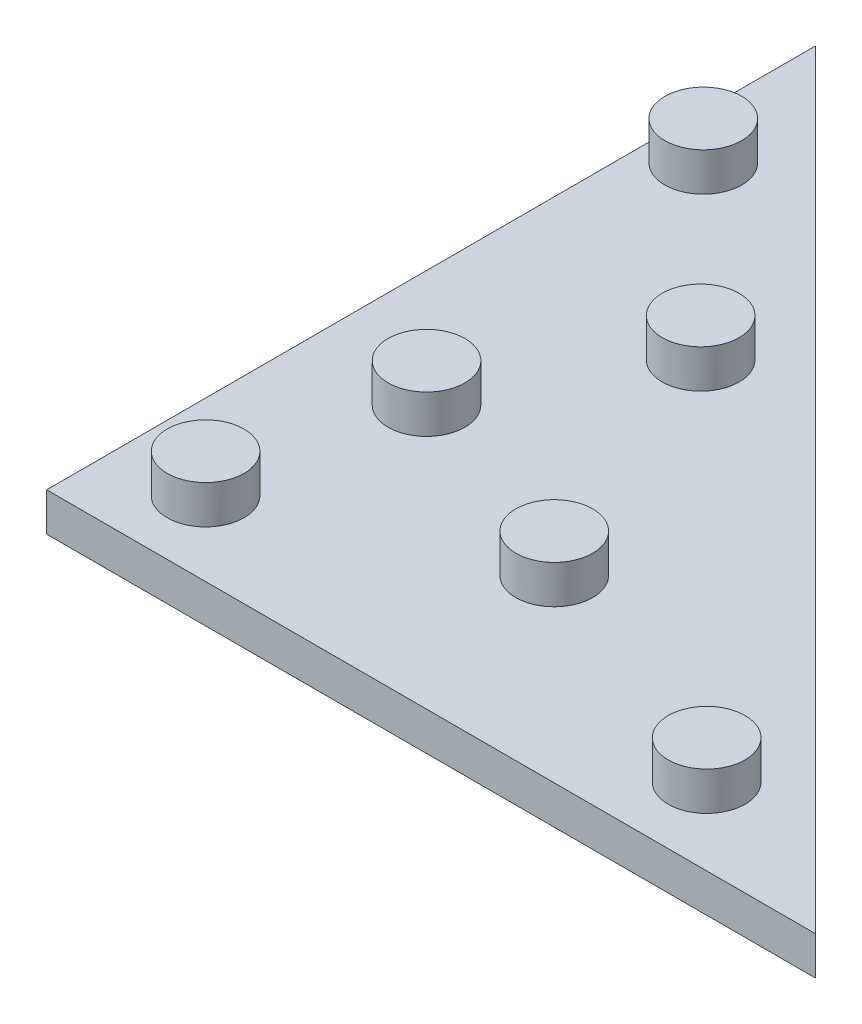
ISO-10303-21;
HEADER;
FILE_DESCRIPTION(('STEP AP214'),'2;1');
FILE_NAME('part.step','',(''),(''),'','','');
FILE_SCHEMA(('AUTOMOTIVE_DESIGN { 1 0 10303 214 1 1 1 1 }'));
ENDSEC;
DATA;
#1=APPLICATION_CONTEXT('core data for automotive mechanical design processes');
#2=APPLICATION_PROTOCOL_DEFINITION('international standard','automotive_design',2000,#1);
#3=PRODUCT_CONTEXT('',#1,'mechanical');
#4=PRODUCT('Part','Part','',(#3));
#5=PRODUCT_RELATED_PRODUCT_CATEGORY('part','',(#4));
#6=PRODUCT_DEFINITION_FORMATION('','',#4);
#7=PRODUCT_DEFINITION_CONTEXT('part definition',#1,'design');
#8=PRODUCT_DEFINITION('design','',#6,#7);
#9=PRODUCT_DEFINITION_SHAPE('','',#8);
#10=(LENGTH_UNIT() NAMED_UNIT(*) SI_UNIT(.MILLI.,.METRE.));
#11=(NAMED_UNIT(*) PLANE_ANGLE_UNIT() SI_UNIT($,.RADIAN.));
#12=(NAMED_UNIT(*) SI_UNIT($,.STERADIAN.) SOLID_ANGLE_UNIT());
#13=UNCERTAINTY_MEASURE_WITH_UNIT(LENGTH_MEASURE(1.E-05),#10,'distance_accuracy_value','');
#14=(GEOMETRIC_REPRESENTATION_CONTEXT(3) GLOBAL_UNCERTAINTY_ASSIGNED_CONTEXT((#13)) GLOBAL_UNIT_ASSIGNED_CONTEXT((#10,
#11,#12)) REPRESENTATION_CONTEXT('',''));
#15=CARTESIAN_POINT('',(0.,0.,0.));
#16=DIRECTION('',(0.,0.,1.));
#17=DIRECTION('',(1.,0.,0.));
#18=AXIS2_PLACEMENT_3D('',#15,#16,#17);
#19=CARTESIAN_POINT('',(0.,5.,0.));
#20=DIRECTION('',(0.,-1.,0.));
#21=DIRECTION('',(0.,0.,-1.));
#22=AXIS2_PLACEMENT_3D('',#19,#20,#21);
#23=PLANE('',#22);
#24=CARTESIAN_POINT('',(27.8957237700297,5.,-57.1843432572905));
#25=DIRECTION('',(0.,-1.,0.));
#26=DIRECTION('',(0.,0.,-1.));
#27=AXIS2_PLACEMENT_3D('',#24,#25,#26);
#28=CIRCLE('',#27,5.);
#29=CARTESIAN_POINT('',(27.8957237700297,5.,-62.1843432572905));
#30=VERTEX_POINT('',#29);
#31=EDGE_CURVE('E41',#30,#30,#28,.F.);
#32=ORIENTED_EDGE('',*,*,#31,.F.);
#33=EDGE_LOOP('',(#32));
#34=FACE_BOUND('',#33,.T.);
#35=CARTESIAN_POINT('',(15.1620921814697,5.,-34.2543620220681));
#36=DIRECTION('',(0.,-1.,0.));
#37=DIRECTION('',(0.,0.,-1.));
#38=AXIS2_PLACEMENT_3D('',#35,#36,#37);
#39=CIRCLE('',#38,5.);
#40=CARTESIAN_POINT('',(15.1620921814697,5.,-39.2543620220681));
#41=VERTEX_POINT('',#40);
#42=EDGE_CURVE('E105',#41,#41,#39,.F.);
#43=ORIENTED_EDGE('',*,*,#42,.F.);
#44=EDGE_LOOP('',(#43));
#45=FACE_BOUND('',#44,.T.);
#46=CARTESIAN_POINT('',(75.8578643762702,5.,-10.));
#47=DIRECTION('',(0.,-1.,0.));
#48=DIRECTION('',(0.,0.,-1.));
#49=AXIS2_PLACEMENT_3D('',#46,#47,#48);
#50=CIRCLE('',#49,5.);
#51=CARTESIAN_POINT('',(75.8578643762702,5.,-15.));
#52=VERTEX_POINT('',#51);
#53=EDGE_CURVE('E81',#52,#52,#50,.F.);
#54=ORIENTED_EDGE('',*,*,#53,.F.);
#55=EDGE_LOOP('',(#54));
#56=FACE_BOUND('',#55,.T.);
#57=DIRECTION('',(1.,0.,0.));
#58=VECTOR('',#57,1.);
#59=CARTESIAN_POINT('',(100.000000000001,5.,0.));
#60=LINE('',#59,#58);
#61=CARTESIAN_POINT('',(0.,5.,0.));
#62=VERTEX_POINT('',#61);
#63=CARTESIAN_POINT('',(100.000000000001,5.,0.));
#64=VERTEX_POINT('',#63);
#65=EDGE_CURVE('E94',#62,#64,#60,.T.);
#66=ORIENTED_EDGE('',*,*,#65,.T.);
#67=DIRECTION('',(-0.707106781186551,0.,-0.707106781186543));
#68=VECTOR('',#67,1.);
#69=CARTESIAN_POINT('',(0.,5.,-100.));
#70=LINE('',#69,#68);
#71=CARTESIAN_POINT('',(0.,5.,-100.));
#72=VERTEX_POINT('',#71);
#73=EDGE_CURVE('E52',#64,#72,#70,.T.);
#74=ORIENTED_EDGE('',*,*,#73,.T.);
#75=DIRECTION('',(0.,0.,1.));
#76=VECTOR('',#75,1.);
#77=CARTESIAN_POINT('',(0.,5.,0.));
#78=LINE('',#77,#76);
#79=EDGE_CURVE('E48',#72,#62,#78,.T.);
#80=ORIENTED_EDGE('',*,*,#79,.T.);
#81=EDGE_LOOP('',(#66,#74,#80));
#82=FACE_BOUND('',#81,.T.);
#83=CARTESIAN_POINT('',(10.989122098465,5.,-9.68869264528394));
#84=DIRECTION('',(0.,-1.,0.));
#85=DIRECTION('',(0.,0.,-1.));
#86=AXIS2_PLACEMENT_3D('',#83,#84,#85);
#87=CIRCLE('',#86,5.);
#88=CARTESIAN_POINT('',(10.989122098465,5.,-14.6886926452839));
#89=VERTEX_POINT('',#88);
#90=EDGE_CURVE('E102',#89,#89,#87,.F.);
#91=ORIENTED_EDGE('',*,*,#90,.F.);
#92=EDGE_LOOP('',(#91));
#93=FACE_BOUND('',#92,.T.);
#94=CARTESIAN_POINT('',(42.6651889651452,5.,-23.3712013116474));
#95=DIRECTION('',(0.,-1.,0.));
#96=DIRECTION('',(0.,0.,-1.));
#97=AXIS2_PLACEMENT_3D('',#94,#95,#96);
#98=CIRCLE('',#97,5.);
#99=CARTESIAN_POINT('',(42.6651889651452,5.,-28.3712013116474));
#100=VERTEX_POINT('',#99);
#101=EDGE_CURVE('E108',#100,#100,#98,.F.);
#102=ORIENTED_EDGE('',*,*,#101,.F.);
#103=EDGE_LOOP('',(#102));
#104=FACE_BOUND('',#103,.T.);
#105=CARTESIAN_POINT('',(5.8767929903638,5.,-79.5495227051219));
#106=DIRECTION('',(0.,-1.,0.));
#107=DIRECTION('',(0.,0.,-1.));
#108=AXIS2_PLACEMENT_3D('',#105,#106,#107);
#109=CIRCLE('',#108,5.);
#110=CARTESIAN_POINT('',(5.8767929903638,5.,-84.5495227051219));
#111=VERTEX_POINT('',#110);
#112=EDGE_CURVE('E11',#111,#111,#109,.F.);
#113=ORIENTED_EDGE('',*,*,#112,.F.);
#114=EDGE_LOOP('',(#113));
#115=FACE_BOUND('',#114,.T.);
#116=ADVANCED_FACE('F33',(#34,#45,#56,#82,#93,#104,#115),#23,.F.);
#117=CARTESIAN_POINT('',(100.000000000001,5.,0.));
#118=DIRECTION('',(0.,0.,-1.));
#119=DIRECTION('',(-1.,0.,0.));
#120=AXIS2_PLACEMENT_3D('',#117,#118,#119);
#121=PLANE('',#120);
#122=DIRECTION('',(1.,0.,0.));
#123=VECTOR('',#122,1.);
#124=CARTESIAN_POINT('',(100.000000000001,0.,0.));
#125=LINE('',#124,#123);
#126=CARTESIAN_POINT('',(0.,0.,0.));
#127=VERTEX_POINT('',#126);
#128=CARTESIAN_POINT('',(100.000000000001,0.,0.));
#129=VERTEX_POINT('',#128);
#130=EDGE_CURVE('E71',#127,#129,#125,.T.);
#131=ORIENTED_EDGE('',*,*,#130,.T.);
#132=DIRECTION('',(0.,-1.,0.));
#133=VECTOR('',#132,1.);
#134=CARTESIAN_POINT('',(100.000000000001,5.,0.));
#135=LINE('',#134,#133);
#136=EDGE_CURVE('E77',#64,#129,#135,.T.);
#137=ORIENTED_EDGE('',*,*,#136,.F.);
#138=ORIENTED_EDGE('',*,*,#65,.F.);
#139=DIRECTION('',(0.,-1.,0.));
#140=VECTOR('',#139,1.);
#141=CARTESIAN_POINT('',(0.,5.,0.));
#142=LINE('',#141,#140);
#143=EDGE_CURVE('E85',#62,#127,#142,.T.);
#144=ORIENTED_EDGE('',*,*,#143,.T.);
#145=EDGE_LOOP('',(#131,#137,#138,#144));
#146=FACE_BOUND('',#145,.T.);
#147=ADVANCED_FACE('F35',(#146),#121,.F.);
#148=CARTESIAN_POINT('',(0.,5.,-100.));
#149=DIRECTION('',(-0.707106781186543,0.,0.707106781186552));
#150=DIRECTION('',(0.707106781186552,0.,0.707106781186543));
#151=AXIS2_PLACEMENT_3D('',#148,#149,#150);
#152=PLANE('',#151);
#153=DIRECTION('',(-0.707106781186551,0.,-0.707106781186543));
#154=VECTOR('',#153,1.);
#155=CARTESIAN_POINT('',(0.,0.,-100.));
#156=LINE('',#155,#154);
#157=CARTESIAN_POINT('',(0.,0.,-100.));
#158=VERTEX_POINT('',#157);
#159=EDGE_CURVE('E67',#129,#158,#156,.T.);
#160=ORIENTED_EDGE('',*,*,#159,.T.);
#161=DIRECTION('',(0.,-1.,0.));
#162=VECTOR('',#161,1.);
#163=CARTESIAN_POINT('',(0.,5.,-100.));
#164=LINE('',#163,#162);
#165=EDGE_CURVE('E82',#72,#158,#164,.T.);
#166=ORIENTED_EDGE('',*,*,#165,.F.);
#167=ORIENTED_EDGE('',*,*,#73,.F.);
#168=ORIENTED_EDGE('',*,*,#136,.T.);
#169=EDGE_LOOP('',(#160,#166,#167,#168));
#170=FACE_BOUND('',#169,.T.);
#171=ADVANCED_FACE('F78',(#170),#152,.F.);
#172=CARTESIAN_POINT('',(0.,5.,0.));
#173=DIRECTION('',(1.,0.,0.));
#174=DIRECTION('',(0.,0.,-1.));
#175=AXIS2_PLACEMENT_3D('',#172,#173,#174);
#176=PLANE('',#175);
#177=DIRECTION('',(0.,0.,1.));
#178=VECTOR('',#177,1.);
#179=CARTESIAN_POINT('',(0.,0.,0.));
#180=LINE('',#179,#178);
#181=EDGE_CURVE('E72',#158,#127,#180,.T.);
#182=ORIENTED_EDGE('',*,*,#181,.T.);
#183=ORIENTED_EDGE('',*,*,#143,.F.);
#184=ORIENTED_EDGE('',*,*,#79,.F.);
#185=ORIENTED_EDGE('',*,*,#165,.T.);
#186=EDGE_LOOP('',(#182,#183,#184,#185));
#187=FACE_BOUND('',#186,.T.);
#188=ADVANCED_FACE('F180',(#187),#176,.F.);
#189=CARTESIAN_POINT('',(0.,0.,0.));
#190=DIRECTION('',(0.,-1.,0.));
#191=DIRECTION('',(0.,0.,-1.));
#192=AXIS2_PLACEMENT_3D('',#189,#190,#191);
#193=PLANE('',#192);
#194=ORIENTED_EDGE('',*,*,#130,.F.);
#195=ORIENTED_EDGE('',*,*,#181,.F.);
#196=ORIENTED_EDGE('',*,*,#159,.F.);
#197=EDGE_LOOP('',(#194,#195,#196));
#198=FACE_BOUND('',#197,.T.);
#199=ADVANCED_FACE('F69',(#198),#193,.T.);
#200=CARTESIAN_POINT('',(75.8578643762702,10.,-10.));
#201=DIRECTION('',(0.,-1.,0.));
#202=DIRECTION('',(0.,0.,-1.));
#203=AXIS2_PLACEMENT_3D('',#200,#201,#202);
#204=CYLINDRICAL_SURFACE('',#203,5.);
#205=CARTESIAN_POINT('',(75.8578643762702,10.,-10.));
#206=DIRECTION('',(0.,1.,0.));
#207=DIRECTION('',(0.,0.,1.));
#208=AXIS2_PLACEMENT_3D('',#205,#206,#207);
#209=CIRCLE('',#208,5.);
#210=CARTESIAN_POINT('',(75.8578643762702,10.,-4.99999999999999));
#211=VERTEX_POINT('',#210);
#212=EDGE_CURVE('E86',#211,#211,#209,.T.);
#213=ORIENTED_EDGE('',*,*,#212,.F.);
#214=EDGE_LOOP('',(#213));
#215=FACE_BOUND('',#214,.T.);
#216=ORIENTED_EDGE('',*,*,#53,.T.);
#217=EDGE_LOOP('',(#216));
#218=FACE_BOUND('',#217,.T.);
#219=ADVANCED_FACE('F174',(#215,#218),#204,.T.);
#220=CARTESIAN_POINT('',(75.8578643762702,10.,-10.));
#221=DIRECTION('',(0.,1.,0.));
#222=DIRECTION('',(0.,0.,1.));
#223=AXIS2_PLACEMENT_3D('',#220,#221,#222);
#224=PLANE('',#223);
#225=ORIENTED_EDGE('',*,*,#212,.T.);
#226=EDGE_LOOP('',(#225));
#227=FACE_BOUND('',#226,.T.);
#228=ADVANCED_FACE('F170',(#227),#224,.T.);
#229=CARTESIAN_POINT('',(10.989122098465,10.,-9.68869264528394));
#230=DIRECTION('',(0.,-1.,0.));
#231=DIRECTION('',(0.,0.,-1.));
#232=AXIS2_PLACEMENT_3D('',#229,#230,#231);
#233=CYLINDRICAL_SURFACE('',#232,5.);
#234=CARTESIAN_POINT('',(10.989122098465,10.,-9.68869264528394));
#235=DIRECTION('',(0.,1.,0.));
#236=DIRECTION('',(0.,0.,1.));
#237=AXIS2_PLACEMENT_3D('',#234,#235,#236);
#238=CIRCLE('',#237,5.);
#239=CARTESIAN_POINT('',(10.989122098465,10.,-4.68869264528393));
#240=VERTEX_POINT('',#239);
#241=EDGE_CURVE('E89',#240,#240,#238,.T.);
#242=ORIENTED_EDGE('',*,*,#241,.F.);
#243=EDGE_LOOP('',(#242));
#244=FACE_BOUND('',#243,.T.);
#245=ORIENTED_EDGE('',*,*,#90,.T.);
#246=EDGE_LOOP('',(#245));
#247=FACE_BOUND('',#246,.T.);
#248=ADVANCED_FACE('F166',(#244,#247),#233,.T.);
#249=CARTESIAN_POINT('',(10.989122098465,10.,-9.68869264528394));
#250=DIRECTION('',(0.,1.,0.));
#251=DIRECTION('',(0.,0.,1.));
#252=AXIS2_PLACEMENT_3D('',#249,#250,#251);
#253=PLANE('',#252);
#254=ORIENTED_EDGE('',*,*,#241,.T.);
#255=EDGE_LOOP('',(#254));
#256=FACE_BOUND('',#255,.T.);
#257=ADVANCED_FACE('F162',(#256),#253,.T.);
#258=CARTESIAN_POINT('',(15.1620921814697,10.,-34.2543620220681));
#259=DIRECTION('',(0.,-1.,0.));
#260=DIRECTION('',(0.,0.,-1.));
#261=AXIS2_PLACEMENT_3D('',#258,#259,#260);
#262=CYLINDRICAL_SURFACE('',#261,5.);
#263=CARTESIAN_POINT('',(15.1620921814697,10.,-34.2543620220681));
#264=DIRECTION('',(0.,1.,0.));
#265=DIRECTION('',(0.,0.,1.));
#266=AXIS2_PLACEMENT_3D('',#263,#264,#265);
#267=CIRCLE('',#266,5.);
#268=CARTESIAN_POINT('',(15.1620921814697,10.,-29.2543620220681));
#269=VERTEX_POINT('',#268);
#270=EDGE_CURVE('E291',#269,#269,#267,.T.);
#271=ORIENTED_EDGE('',*,*,#270,.F.);
#272=EDGE_LOOP('',(#271));
#273=FACE_BOUND('',#272,.T.);
#274=ORIENTED_EDGE('',*,*,#42,.T.);
#275=EDGE_LOOP('',(#274));
#276=FACE_BOUND('',#275,.T.);
#277=ADVANCED_FACE('F158',(#273,#276),#262,.T.);
#278=CARTESIAN_POINT('',(15.1620921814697,10.,-34.2543620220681));
#279=DIRECTION('',(0.,1.,0.));
#280=DIRECTION('',(0.,0.,1.));
#281=AXIS2_PLACEMENT_3D('',#278,#279,#280);
#282=PLANE('',#281);
#283=ORIENTED_EDGE('',*,*,#270,.T.);
#284=EDGE_LOOP('',(#283));
#285=FACE_BOUND('',#284,.T.);
#286=ADVANCED_FACE('F154',(#285),#282,.T.);
#287=CARTESIAN_POINT('',(42.6651889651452,10.,-23.3712013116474));
#288=DIRECTION('',(0.,-1.,0.));
#289=DIRECTION('',(0.,0.,-1.));
#290=AXIS2_PLACEMENT_3D('',#287,#288,#289);
#291=CYLINDRICAL_SURFACE('',#290,5.);
#292=CARTESIAN_POINT('',(42.6651889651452,10.,-23.3712013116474));
#293=DIRECTION('',(0.,1.,0.));
#294=DIRECTION('',(0.,0.,1.));
#295=AXIS2_PLACEMENT_3D('',#292,#293,#294);
#296=CIRCLE('',#295,5.);
#297=CARTESIAN_POINT('',(42.6651889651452,10.,-18.3712013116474));
#298=VERTEX_POINT('',#297);
#299=EDGE_CURVE('E293',#298,#298,#296,.T.);
#300=ORIENTED_EDGE('',*,*,#299,.F.);
#301=EDGE_LOOP('',(#300));
#302=FACE_BOUND('',#301,.T.);
#303=ORIENTED_EDGE('',*,*,#101,.T.);
#304=EDGE_LOOP('',(#303));
#305=FACE_BOUND('',#304,.T.);
#306=ADVANCED_FACE('F150',(#302,#305),#291,.T.);
#307=CARTESIAN_POINT('',(42.6651889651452,10.,-23.3712013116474));
#308=DIRECTION('',(0.,1.,0.));
#309=DIRECTION('',(0.,0.,1.));
#310=AXIS2_PLACEMENT_3D('',#307,#308,#309);
#311=PLANE('',#310);
#312=ORIENTED_EDGE('',*,*,#299,.T.);
#313=EDGE_LOOP('',(#312));
#314=FACE_BOUND('',#313,.T.);
#315=ADVANCED_FACE('F146',(#314),#311,.T.);
#316=CARTESIAN_POINT('',(27.8957237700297,10.,-57.1843432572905));
#317=DIRECTION('',(0.,-1.,0.));
#318=DIRECTION('',(0.,0.,-1.));
#319=AXIS2_PLACEMENT_3D('',#316,#317,#318);
#320=CYLINDRICAL_SURFACE('',#319,5.);
#321=CARTESIAN_POINT('',(27.8957237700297,10.,-57.1843432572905));
#322=DIRECTION('',(0.,1.,0.));
#323=DIRECTION('',(0.,0.,1.));
#324=AXIS2_PLACEMENT_3D('',#321,#322,#323);
#325=CIRCLE('',#324,5.);
#326=CARTESIAN_POINT('',(27.8957237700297,10.,-52.1843432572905));
#327=VERTEX_POINT('',#326);
#328=EDGE_CURVE('E298',#327,#327,#325,.T.);
#329=ORIENTED_EDGE('',*,*,#328,.F.);
#330=EDGE_LOOP('',(#329));
#331=FACE_BOUND('',#330,.T.);
#332=ORIENTED_EDGE('',*,*,#31,.T.);
#333=EDGE_LOOP('',(#332));
#334=FACE_BOUND('',#333,.T.);
#335=ADVANCED_FACE('F113',(#331,#334),#320,.T.);
#336=CARTESIAN_POINT('',(27.8957237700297,10.,-57.1843432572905));
#337=DIRECTION('',(0.,1.,0.));
#338=DIRECTION('',(0.,0.,1.));
#339=AXIS2_PLACEMENT_3D('',#336,#337,#338);
#340=PLANE('',#339);
#341=ORIENTED_EDGE('',*,*,#328,.T.);
#342=EDGE_LOOP('',(#341));
#343=FACE_BOUND('',#342,.T.);
#344=ADVANCED_FACE('F131',(#343),#340,.T.);
#345=CARTESIAN_POINT('',(5.8767929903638,10.,-79.5495227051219));
#346=DIRECTION('',(0.,-1.,0.));
#347=DIRECTION('',(0.,0.,-1.));
#348=AXIS2_PLACEMENT_3D('',#345,#346,#347);
#349=CYLINDRICAL_SURFACE('',#348,5.);
#350=CARTESIAN_POINT('',(5.8767929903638,10.,-79.5495227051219));
#351=DIRECTION('',(0.,1.,0.));
#352=DIRECTION('',(0.,0.,1.));
#353=AXIS2_PLACEMENT_3D('',#350,#351,#352);
#354=CIRCLE('',#353,5.);
#355=CARTESIAN_POINT('',(5.8767929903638,10.,-74.5495227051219));
#356=VERTEX_POINT('',#355);
#357=EDGE_CURVE('E301',#356,#356,#354,.T.);
#358=ORIENTED_EDGE('',*,*,#357,.F.);
#359=EDGE_LOOP('',(#358));
#360=FACE_BOUND('',#359,.T.);
#361=ORIENTED_EDGE('',*,*,#112,.T.);
#362=EDGE_LOOP('',(#361));
#363=FACE_BOUND('',#362,.T.);
#364=ADVANCED_FACE('F128',(#360,#363),#349,.T.);
#365=CARTESIAN_POINT('',(5.8767929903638,10.,-79.5495227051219));
#366=DIRECTION('',(0.,1.,0.));
#367=DIRECTION('',(0.,0.,1.));
#368=AXIS2_PLACEMENT_3D('',#365,#366,#367);
#369=PLANE('',#368);
#370=ORIENTED_EDGE('',*,*,#357,.T.);
#371=EDGE_LOOP('',(#370));
#372=FACE_BOUND('',#371,.T.);
#373=ADVANCED_FACE('F130',(#372),#369,.T.);
#374=CLOSED_SHELL('',(#116,#147,#171,#188,#199,#219,#228,#248,#257,#277,#286,#306,#315,#335,
#344,#364,#373));
#375=MANIFOLD_SOLID_BREP('B2',#374);
#376=ADVANCED_BREP_SHAPE_REPRESENTATION('',(#18,#375),#14);
#377=SHAPE_DEFINITION_REPRESENTATION(#9,#376);
ENDSEC;
END-ISO-10303-21;
